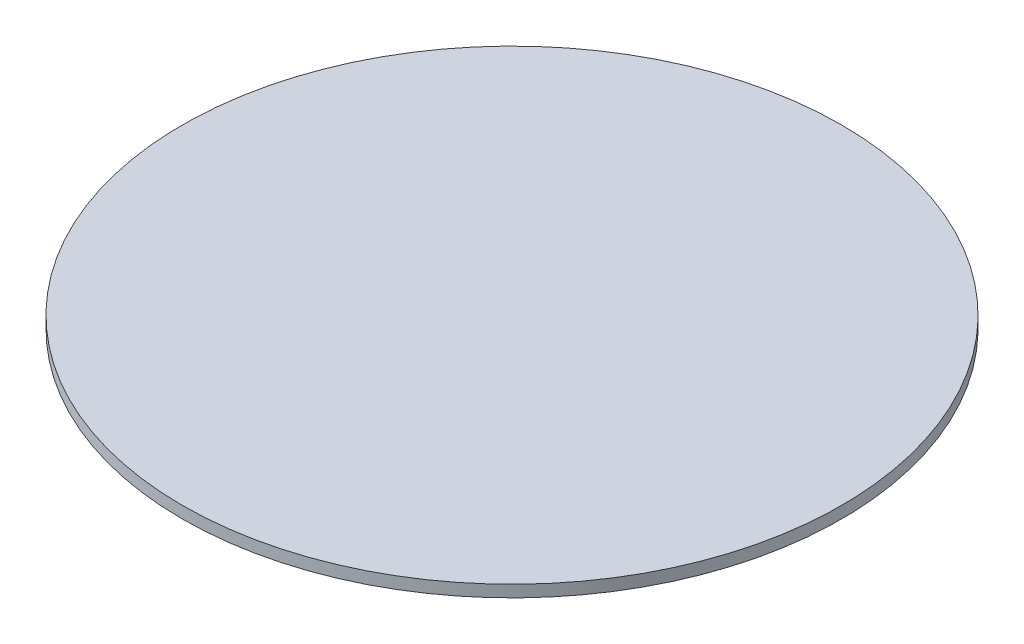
from build123d import *

# Parameters (mm, degrees)
SKETCH1_R           = 177
BOSS_EXTRUDE1_DEPTH = 6.35


with BuildPart() as part:
    # Sketch1 → Boss-Extrude1 (new body)
    with BuildSketch(Plane(origin=(0, 0, 0), x_dir=(1, 0, 0), z_dir=(0, 1, 0))):
        with Locations(Location((0, 0, 0), (0, 0, 270))):
            Circle(SKETCH1_R)
    extrude(amount=BOSS_EXTRUDE1_DEPTH)


solid = part.part
